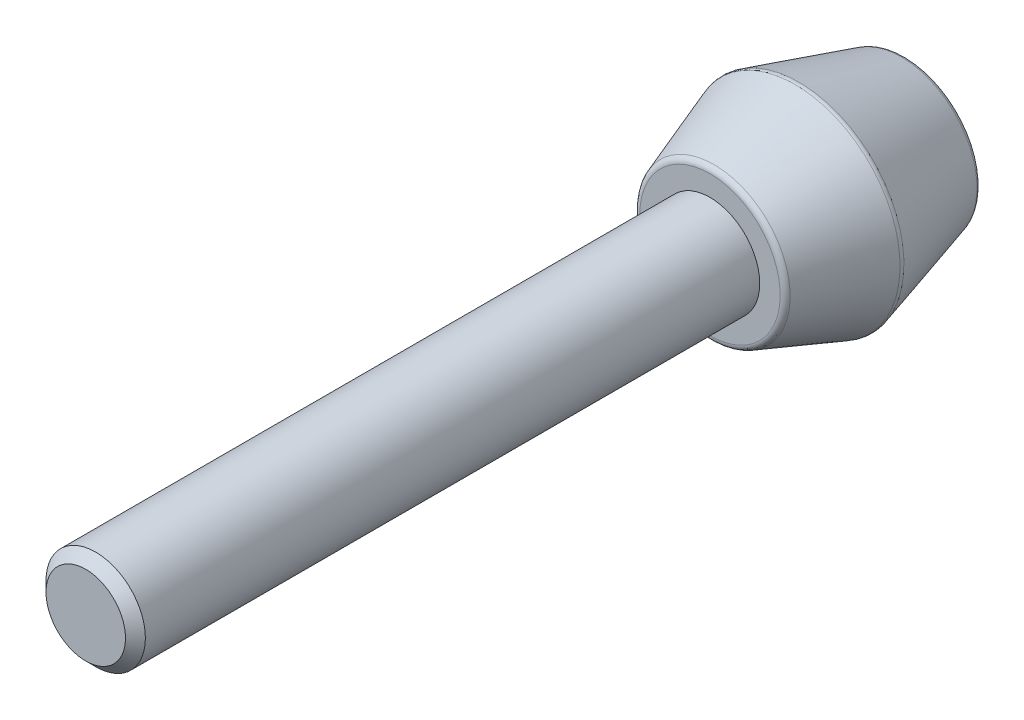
ISO-10303-21;
HEADER;
FILE_DESCRIPTION(('STEP AP214'),'2;1');
FILE_NAME('part.step','',(''),(''),'','','');
FILE_SCHEMA(('AUTOMOTIVE_DESIGN { 1 0 10303 214 1 1 1 1 }'));
ENDSEC;
DATA;
#1=APPLICATION_CONTEXT('core data for automotive mechanical design processes');
#2=APPLICATION_PROTOCOL_DEFINITION('international standard','automotive_design',2000,#1);
#3=PRODUCT_CONTEXT('',#1,'mechanical');
#4=PRODUCT('Part','Part','',(#3));
#5=PRODUCT_RELATED_PRODUCT_CATEGORY('part','',(#4));
#6=PRODUCT_DEFINITION_FORMATION('','',#4);
#7=PRODUCT_DEFINITION_CONTEXT('part definition',#1,'design');
#8=PRODUCT_DEFINITION('design','',#6,#7);
#9=PRODUCT_DEFINITION_SHAPE('','',#8);
#10=(LENGTH_UNIT() NAMED_UNIT(*) SI_UNIT(.MILLI.,.METRE.));
#11=(NAMED_UNIT(*) PLANE_ANGLE_UNIT() SI_UNIT($,.RADIAN.));
#12=(NAMED_UNIT(*) SI_UNIT($,.STERADIAN.) SOLID_ANGLE_UNIT());
#13=UNCERTAINTY_MEASURE_WITH_UNIT(LENGTH_MEASURE(1.E-05),#10,'distance_accuracy_value','');
#14=(GEOMETRIC_REPRESENTATION_CONTEXT(3) GLOBAL_UNCERTAINTY_ASSIGNED_CONTEXT((#13)) GLOBAL_UNIT_ASSIGNED_CONTEXT((#10,
#11,#12)) REPRESENTATION_CONTEXT('',''));
#15=CARTESIAN_POINT('',(0.,0.,0.));
#16=DIRECTION('',(0.,0.,1.));
#17=DIRECTION('',(1.,0.,0.));
#18=AXIS2_PLACEMENT_3D('',#15,#16,#17);
#19=CARTESIAN_POINT('',(0.,0.,2.75));
#20=DIRECTION('',(0.,0.,1.));
#21=DIRECTION('',(-0.481271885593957,-0.876571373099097,0.));
#22=AXIS2_PLACEMENT_3D('',#19,#20,#21);
#23=CYLINDRICAL_SURFACE('',#22,4.);
#24=CARTESIAN_POINT('',(0.,0.,65.2));
#25=DIRECTION('',(0.,0.,-1.));
#26=DIRECTION('',(0.481271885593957,0.876571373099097,0.));
#27=AXIS2_PLACEMENT_3D('',#24,#25,#26);
#28=CIRCLE('',#27,4.);
#29=CARTESIAN_POINT('',(1.92508754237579,3.50628549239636,65.2));
#30=VERTEX_POINT('',#29);
#31=EDGE_CURVE('E20',#30,#30,#28,.T.);
#32=ORIENTED_EDGE('',*,*,#31,.T.);
#33=EDGE_LOOP('',(#32));
#34=FACE_BOUND('',#33,.T.);
#35=CARTESIAN_POINT('',(0.,0.,15.75));
#36=DIRECTION('',(0.,0.,-1.));
#37=DIRECTION('',(1.,0.,0.));
#38=AXIS2_PLACEMENT_3D('',#35,#36,#37);
#39=CIRCLE('',#38,4.);
#40=CARTESIAN_POINT('',(3.99999999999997,0.,15.75));
#41=VERTEX_POINT('',#40);
#42=EDGE_CURVE('E8',#41,#41,#39,.F.);
#43=ORIENTED_EDGE('',*,*,#42,.T.);
#44=EDGE_LOOP('',(#43));
#45=FACE_BOUND('',#44,.T.);
#46=ADVANCED_FACE('F12',(#34,#45),#23,.T.);
#47=CARTESIAN_POINT('',(0.,0.,65.2));
#48=DIRECTION('',(0.,0.,-1.));
#49=DIRECTION('',(0.481271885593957,0.876571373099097,0.));
#50=AXIS2_PLACEMENT_3D('',#47,#48,#49);
#51=CONICAL_SURFACE('',#50,4.,0.785398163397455);
#52=ORIENTED_EDGE('',*,*,#31,.F.);
#53=EDGE_LOOP('',(#52));
#54=FACE_BOUND('',#53,.T.);
#55=CARTESIAN_POINT('',(0.,0.,66.));
#56=DIRECTION('',(0.,0.,1.));
#57=DIRECTION('',(0.481271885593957,0.876571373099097,0.));
#58=AXIS2_PLACEMENT_3D('',#55,#56,#57);
#59=CIRCLE('',#58,3.2);
#60=CARTESIAN_POINT('',(1.54007003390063,2.80502839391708,66.));
#61=VERTEX_POINT('',#60);
#62=EDGE_CURVE('E26',#61,#61,#59,.T.);
#63=ORIENTED_EDGE('',*,*,#62,.F.);
#64=EDGE_LOOP('',(#63));
#65=FACE_BOUND('',#64,.T.);
#66=ADVANCED_FACE('F73',(#54,#65),#51,.T.);
#67=CARTESIAN_POINT('',(0.,0.,66.));
#68=DIRECTION('',(0.,0.,-1.));
#69=DIRECTION('',(0.481271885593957,0.876571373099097,0.));
#70=AXIS2_PLACEMENT_3D('',#67,#68,#69);
#71=PLANE('',#70);
#72=ORIENTED_EDGE('',*,*,#62,.T.);
#73=EDGE_LOOP('',(#72));
#74=FACE_BOUND('',#73,.T.);
#75=ADVANCED_FACE('F80',(#74),#71,.F.);
#76=CARTESIAN_POINT('',(0.,0.,0.));
#77=DIRECTION('',(0.,0.,-1.));
#78=DIRECTION('',(0.379653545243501,0.925128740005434,0.));
#79=AXIS2_PLACEMENT_3D('',#76,#77,#78);
#80=PLANE('',#79);
#81=CARTESIAN_POINT('',(0.,0.,0.));
#82=DIRECTION('',(0.,0.,-1.));
#83=DIRECTION('',(0.379653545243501,0.925128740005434,0.));
#84=AXIS2_PLACEMENT_3D('',#81,#82,#83);
#85=CIRCLE('',#84,5.62284929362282);
#86=CARTESIAN_POINT('',(2.13473466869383,5.20185948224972,0.));
#87=VERTEX_POINT('',#86);
#88=EDGE_CURVE('E30',#87,#87,#85,.T.);
#89=ORIENTED_EDGE('',*,*,#88,.T.);
#90=EDGE_LOOP('',(#89));
#91=FACE_BOUND('',#90,.T.);
#92=ADVANCED_FACE('F86',(#91),#80,.T.);
#93=CARTESIAN_POINT('',(0.,0.,0.499999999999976));
#94=DIRECTION('',(0.,0.,-1.));
#95=DIRECTION('',(0.379653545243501,0.925128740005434,0.));
#96=AXIS2_PLACEMENT_3D('',#93,#94,#95);
#97=TOROIDAL_SURFACE('',#96,5.62284929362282,0.5);
#98=ORIENTED_EDGE('',*,*,#88,.F.);
#99=EDGE_LOOP('',(#98));
#100=FACE_BOUND('',#99,.T.);
#101=CARTESIAN_POINT('',(0.,0.,0.362639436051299));
#102=DIRECTION('',(0.,0.,1.));
#103=DIRECTION('',(0.379653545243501,0.925128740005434,0.));
#104=AXIS2_PLACEMENT_3D('',#101,#102,#103);
#105=CIRCLE('',#104,6.10361126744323);
#106=CARTESIAN_POINT('',(2.31725765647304,5.64662620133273,0.3626394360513));
#107=VERTEX_POINT('',#106);
#108=EDGE_CURVE('E43',#107,#107,#105,.T.);
#109=ORIENTED_EDGE('',*,*,#108,.F.);
#110=EDGE_LOOP('',(#109));
#111=FACE_BOUND('',#110,.T.);
#112=ADVANCED_FACE('F67',(#100,#111),#97,.T.);
#113=CARTESIAN_POINT('',(0.,0.,0.));
#114=DIRECTION('',(0.,0.,1.));
#115=DIRECTION('',(-0.379653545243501,-0.925128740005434,0.));
#116=AXIS2_PLACEMENT_3D('',#113,#114,#115);
#117=CONICAL_SURFACE('',#116,6.,0.278299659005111);
#118=CARTESIAN_POINT('',(0.,0.,8.59564782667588));
#119=DIRECTION('',(0.,0.,-1.));
#120=DIRECTION('',(0.379653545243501,0.925128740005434,0.));
#121=AXIS2_PLACEMENT_3D('',#118,#119,#120);
#122=CIRCLE('',#121,8.45589937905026);
#123=CARTESIAN_POINT('',(3.21031217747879,7.8227955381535,8.59564782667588));
#124=VERTEX_POINT('',#123);
#125=EDGE_CURVE('E16',#124,#124,#122,.T.);
#126=ORIENTED_EDGE('',*,*,#125,.T.);
#127=EDGE_LOOP('',(#126));
#128=FACE_BOUND('',#127,.T.);
#129=ORIENTED_EDGE('',*,*,#108,.T.);
#130=EDGE_LOOP('',(#129));
#131=FACE_BOUND('',#130,.T.);
#132=ADVANCED_FACE('F14',(#128,#131),#117,.T.);
#133=CARTESIAN_POINT('',(0.,0.,8.7330083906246));
#134=DIRECTION('',(0.,0.,-1.));
#135=DIRECTION('',(0.379653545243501,0.925128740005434,0.));
#136=AXIS2_PLACEMENT_3D('',#133,#134,#135);
#137=TOROIDAL_SURFACE('',#136,7.97513740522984,0.5);
#138=ORIENTED_EDGE('',*,*,#125,.F.);
#139=EDGE_LOOP('',(#138));
#140=FACE_BOUND('',#139,.T.);
#141=CARTESIAN_POINT('',(0.,0.,8.90117658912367));
#142=DIRECTION('',(0.,0.,1.));
#143=DIRECTION('',(-0.379653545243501,-0.925128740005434,0.));
#144=AXIS2_PLACEMENT_3D('',#141,#142,#143);
#145=CIRCLE('',#144,8.44600836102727);
#146=CARTESIAN_POINT('',(-3.20655701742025,-7.81364507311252,8.90117658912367));
#147=VERTEX_POINT('',#146);
#148=EDGE_CURVE('E42',#147,#147,#145,.T.);
#149=ORIENTED_EDGE('',*,*,#148,.F.);
#150=EDGE_LOOP('',(#149));
#151=FACE_BOUND('',#150,.T.);
#152=ADVANCED_FACE('F55',(#140,#151),#137,.T.);
#153=CARTESIAN_POINT('',(0.,0.,15.75));
#154=DIRECTION('',(0.,0.,-1.));
#155=DIRECTION('',(0.379653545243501,0.925128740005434,0.));
#156=AXIS2_PLACEMENT_3D('',#153,#154,#155);
#157=CONICAL_SURFACE('',#156,6.,0.343023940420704);
#158=ORIENTED_EDGE('',*,*,#148,.T.);
#159=EDGE_LOOP('',(#158));
#160=FACE_BOUND('',#159,.T.);
#161=CARTESIAN_POINT('',(0.,0.,15.4181681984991));
#162=DIRECTION('',(0.,0.,-1.));
#163=DIRECTION('',(0.379653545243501,0.925128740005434,0.));
#164=AXIS2_PLACEMENT_3D('',#161,#162,#163);
#165=CIRCLE('',#164,6.1185113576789);
#166=CARTESIAN_POINT('',(2.32291452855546,5.66041070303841,15.4181681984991));
#167=VERTEX_POINT('',#166);
#168=EDGE_CURVE('E38',#167,#167,#165,.T.);
#169=ORIENTED_EDGE('',*,*,#168,.T.);
#170=EDGE_LOOP('',(#169));
#171=FACE_BOUND('',#170,.T.);
#172=ADVANCED_FACE('F52',(#160,#171),#157,.T.);
#173=CARTESIAN_POINT('',(0.,0.,15.25));
#174=DIRECTION('',(0.,0.,-1.));
#175=DIRECTION('',(0.379653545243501,0.925128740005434,0.));
#176=AXIS2_PLACEMENT_3D('',#173,#174,#175);
#177=TOROIDAL_SURFACE('',#176,5.64764040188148,0.5);
#178=ORIENTED_EDGE('',*,*,#168,.F.);
#179=EDGE_LOOP('',(#178));
#180=FACE_BOUND('',#179,.T.);
#181=CARTESIAN_POINT('',(0.,0.,15.75));
#182=DIRECTION('',(0.,0.,1.));
#183=DIRECTION('',(0.379653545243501,0.925128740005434,0.));
#184=AXIS2_PLACEMENT_3D('',#181,#182,#183);
#185=CIRCLE('',#184,5.64764040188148);
#186=CARTESIAN_POINT('',(2.14414670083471,5.22479444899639,15.75));
#187=VERTEX_POINT('',#186);
#188=EDGE_CURVE('E34',#187,#187,#185,.T.);
#189=ORIENTED_EDGE('',*,*,#188,.F.);
#190=EDGE_LOOP('',(#189));
#191=FACE_BOUND('',#190,.T.);
#192=ADVANCED_FACE('F65',(#180,#191),#177,.T.);
#193=CARTESIAN_POINT('',(0.,0.,15.75));
#194=DIRECTION('',(0.,0.,-1.));
#195=DIRECTION('',(0.379653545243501,0.925128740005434,0.));
#196=AXIS2_PLACEMENT_3D('',#193,#194,#195);
#197=PLANE('',#196);
#198=ORIENTED_EDGE('',*,*,#188,.T.);
#199=EDGE_LOOP('',(#198));
#200=FACE_BOUND('',#199,.T.);
#201=ORIENTED_EDGE('',*,*,#42,.F.);
#202=EDGE_LOOP('',(#201));
#203=FACE_BOUND('',#202,.T.);
#204=ADVANCED_FACE('F88',(#200,#203),#197,.F.);
#205=CLOSED_SHELL('',(#46,#66,#75,#92,#112,#132,#152,#172,#192,#204));
#206=MANIFOLD_SOLID_BREP('B1',#205);
#207=ADVANCED_BREP_SHAPE_REPRESENTATION('',(#18,#206),#14);
#208=SHAPE_DEFINITION_REPRESENTATION(#9,#207);
ENDSEC;
END-ISO-10303-21;
